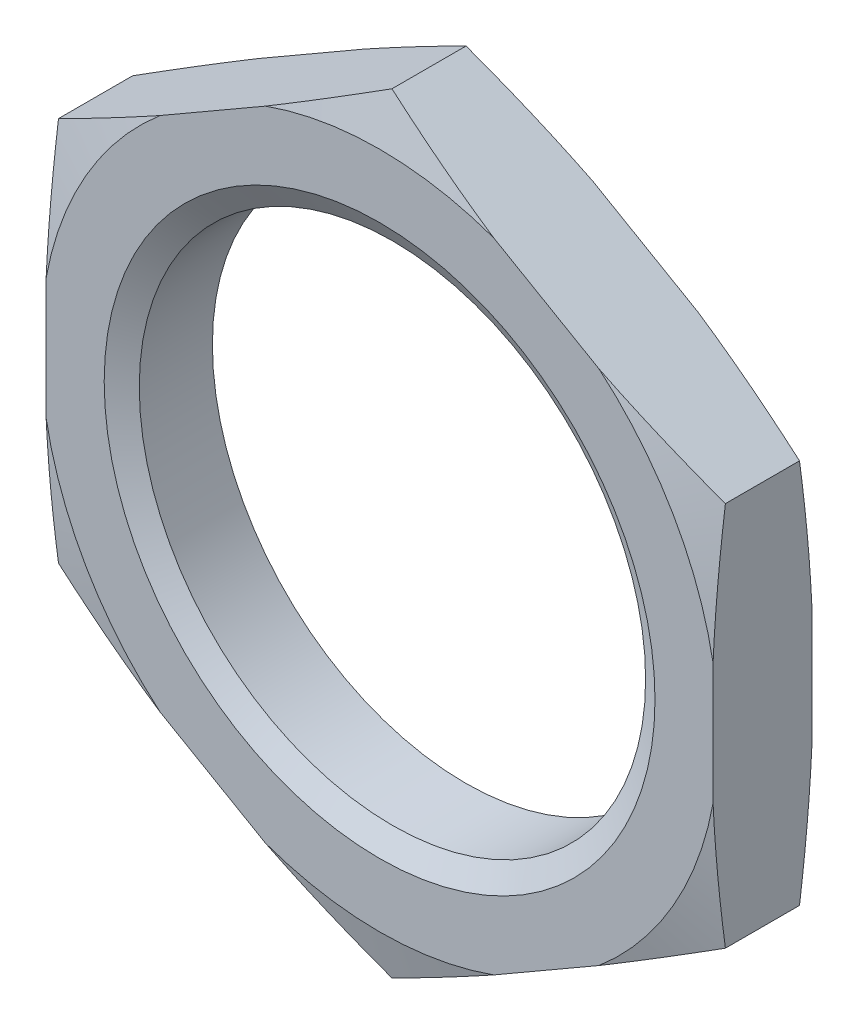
ISO-10303-21;
HEADER;
FILE_DESCRIPTION(('STEP AP214'),'2;1');
FILE_NAME('part.step','',(''),(''),'','','');
FILE_SCHEMA(('AUTOMOTIVE_DESIGN { 1 0 10303 214 1 1 1 1 }'));
ENDSEC;
DATA;
#1=APPLICATION_CONTEXT('core data for automotive mechanical design processes');
#2=APPLICATION_PROTOCOL_DEFINITION('international standard','automotive_design',2000,#1);
#3=PRODUCT_CONTEXT('',#1,'mechanical');
#4=PRODUCT('Part','Part','',(#3));
#5=PRODUCT_RELATED_PRODUCT_CATEGORY('part','',(#4));
#6=PRODUCT_DEFINITION_FORMATION('','',#4);
#7=PRODUCT_DEFINITION_CONTEXT('part definition',#1,'design');
#8=PRODUCT_DEFINITION('design','',#6,#7);
#9=PRODUCT_DEFINITION_SHAPE('','',#8);
#10=(LENGTH_UNIT() NAMED_UNIT(*) SI_UNIT(.MILLI.,.METRE.));
#11=(NAMED_UNIT(*) PLANE_ANGLE_UNIT() SI_UNIT($,.RADIAN.));
#12=(NAMED_UNIT(*) SI_UNIT($,.STERADIAN.) SOLID_ANGLE_UNIT());
#13=UNCERTAINTY_MEASURE_WITH_UNIT(LENGTH_MEASURE(1.E-05),#10,'distance_accuracy_value','');
#14=(GEOMETRIC_REPRESENTATION_CONTEXT(3) GLOBAL_UNCERTAINTY_ASSIGNED_CONTEXT((#13)) GLOBAL_UNIT_ASSIGNED_CONTEXT((#10,
#11,#12)) REPRESENTATION_CONTEXT('',''));
#15=CARTESIAN_POINT('',(0.,0.,0.));
#16=DIRECTION('',(0.,0.,1.));
#17=DIRECTION('',(1.,0.,0.));
#18=AXIS2_PLACEMENT_3D('',#15,#16,#17);
#19=CARTESIAN_POINT('',(0.,0.,4.));
#20=DIRECTION('',(0.,0.,1.));
#21=DIRECTION('',(1.,0.,0.));
#22=AXIS2_PLACEMENT_3D('',#19,#20,#21);
#23=CONICAL_SURFACE('',#22,11.15,1.0471975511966);
#24=CARTESIAN_POINT('',(0.,0.,3.48038475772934));
#25=DIRECTION('',(0.,0.,-1.));
#26=DIRECTION('',(-1.,0.,0.));
#27=AXIS2_PLACEMENT_3D('',#24,#25,#26);
#28=CIRCLE('',#27,10.25);
#29=CARTESIAN_POINT('',(-10.25,0.,3.48038475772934));
#30=VERTEX_POINT('',#29);
#31=EDGE_CURVE('E175',#30,#30,#28,.T.);
#32=ORIENTED_EDGE('',*,*,#31,.T.);
#33=EDGE_LOOP('',(#32));
#34=FACE_BOUND('',#33,.T.);
#35=CARTESIAN_POINT('',(0.,0.,4.));
#36=DIRECTION('',(0.,0.,1.));
#37=DIRECTION('',(1.,0.,0.));
#38=AXIS2_PLACEMENT_3D('',#35,#36,#37);
#39=CIRCLE('',#38,11.15);
#40=CARTESIAN_POINT('',(11.15,0.,4.));
#41=VERTEX_POINT('',#40);
#42=EDGE_CURVE('E430',#41,#41,#39,.T.);
#43=ORIENTED_EDGE('',*,*,#42,.T.);
#44=EDGE_LOOP('',(#43));
#45=FACE_BOUND('',#44,.T.);
#46=ADVANCED_FACE('F15',(#34,#45),#23,.F.);
#47=CARTESIAN_POINT('',(0.,0.,3.497));
#48=DIRECTION('',(0.,0.,-1.));
#49=DIRECTION('',(-1.,0.,0.));
#50=AXIS2_PLACEMENT_3D('',#47,#48,#49);
#51=CONICAL_SURFACE('',#50,15.5996534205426,1.30899693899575);
#52=CARTESIAN_POINT('',(0.,0.,4.));
#53=DIRECTION('',(0.,0.,-1.));
#54=DIRECTION('',(-1.,0.,0.));
#55=AXIS2_PLACEMENT_3D('',#52,#53,#54);
#56=CIRCLE('',#55,13.7224318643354);
#57=CARTESIAN_POINT('',(-8.8810448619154,-10.4609836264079,4.));
#58=VERTEX_POINT('',#57);
#59=CARTESIAN_POINT('',(-13.5,-2.46071864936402,4.));
#60=VERTEX_POINT('',#59);
#61=EDGE_CURVE('E433',#58,#60,#56,.T.);
#62=ORIENTED_EDGE('',*,*,#61,.T.);
#63=CARTESIAN_POINT('',(-13.5,-2.46071864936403,4.));
#64=CARTESIAN_POINT('',(-13.5,-2.90688417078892,3.97859689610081));
#65=CARTESIAN_POINT('',(-13.5,-3.35275366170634,3.95149409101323));
#66=CARTESIAN_POINT('',(-13.5,-4.24353273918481,3.88683268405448));
#67=CARTESIAN_POINT('',(-13.5,-4.68844267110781,3.84927886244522));
#68=CARTESIAN_POINT('',(-13.5,-5.57730597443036,3.76464126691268));
#69=CARTESIAN_POINT('',(-13.5,-6.02125942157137,3.71755827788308));
#70=CARTESIAN_POINT('',(-13.5,-6.90839120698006,3.61489109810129));
#71=CARTESIAN_POINT('',(-13.5,-7.35156909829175,3.55930303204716));
#72=CARTESIAN_POINT('',(-13.5,-7.79422863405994,3.5));
#73=B_SPLINE_CURVE_WITH_KNOTS('',3,(#63,#64,#65,#66,#67,#68,#69,#70,#71,#72),.UNSPECIFIED.,.F.,
.F.,(4,2,2,2,4),(0.,1.33996726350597,2.67932263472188,4.01856773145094,5.35842487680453),.UNSPECIFIED.);
#74=CARTESIAN_POINT('',(-13.5,-7.79422863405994,3.5));
#75=VERTEX_POINT('',#74);
#76=EDGE_CURVE('E158',#60,#75,#73,.T.);
#77=ORIENTED_EDGE('',*,*,#76,.T.);
#78=CARTESIAN_POINT('',(-13.5,-7.79422863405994,3.5));
#79=CARTESIAN_POINT('',(-13.1166455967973,-8.01555840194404,3.55930303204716));
#80=CARTESIAN_POINT('',(-12.7328422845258,-8.23714734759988,3.61489109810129));
#81=CARTESIAN_POINT('',(-11.9645636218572,-8.68071324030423,3.71755827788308));
#82=CARTESIAN_POINT('',(-11.5800886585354,-8.90268996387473,3.76464126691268));
#83=CARTESIAN_POINT('',(-10.8103104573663,-9.34712161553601,3.84927886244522));
#84=CARTESIAN_POINT('',(-10.425007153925,-9.56957658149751,3.88683268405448));
#85=CARTESIAN_POINT('',(-9.653569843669,-10.0149661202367,3.95149409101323));
#86=CARTESIAN_POINT('',(-9.26743553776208,-10.2379008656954,3.97859689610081));
#87=CARTESIAN_POINT('',(-8.8810448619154,-10.4609836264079,4.));
#88=B_SPLINE_CURVE_WITH_KNOTS('',3,(#78,#79,#80,#81,#82,#83,#84,#85,#86,#87),.UNSPECIFIED.,.F.,
.F.,(4,2,2,2,4),(0.,1.33985714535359,2.67910224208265,4.01845761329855,5.35842487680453),.UNSPECIFIED.);
#89=EDGE_CURVE('E169',#75,#58,#88,.T.);
#90=ORIENTED_EDGE('',*,*,#89,.T.);
#91=EDGE_LOOP('',(#62,#77,#90));
#92=FACE_BOUND('',#91,.T.);
#93=ADVANCED_FACE('F489',(#92),#51,.T.);
#94=CARTESIAN_POINT('',(0.,0.,3.497));
#95=DIRECTION('',(0.,0.,-1.));
#96=DIRECTION('',(0.,1.,0.));
#97=AXIS2_PLACEMENT_3D('',#94,#95,#96);
#98=CONICAL_SURFACE('',#97,15.5996534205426,1.30899693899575);
#99=CARTESIAN_POINT('',(0.,0.,4.));
#100=DIRECTION('',(0.,0.,-1.));
#101=DIRECTION('',(0.,1.,0.));
#102=AXIS2_PLACEMENT_3D('',#99,#100,#101);
#103=CIRCLE('',#102,13.7224318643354);
#104=CARTESIAN_POINT('',(-13.5,2.46071864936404,4.));
#105=VERTEX_POINT('',#104);
#106=CARTESIAN_POINT('',(-8.88104486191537,10.4609836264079,4.));
#107=VERTEX_POINT('',#106);
#108=EDGE_CURVE('E18',#105,#107,#103,.T.);
#109=ORIENTED_EDGE('',*,*,#108,.T.);
#110=CARTESIAN_POINT('',(-8.88104486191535,10.4609836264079,4.));
#111=CARTESIAN_POINT('',(-9.26743553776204,10.2379008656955,3.97859689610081));
#112=CARTESIAN_POINT('',(-9.65356984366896,10.0149661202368,3.95149409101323));
#113=CARTESIAN_POINT('',(-10.425007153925,9.56957658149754,3.88683268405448));
#114=CARTESIAN_POINT('',(-10.8103104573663,9.34712161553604,3.84927886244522));
#115=CARTESIAN_POINT('',(-11.5800886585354,8.90268996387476,3.76464126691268));
#116=CARTESIAN_POINT('',(-11.9645636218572,8.68071324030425,3.71755827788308));
#117=CARTESIAN_POINT('',(-12.7328422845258,8.2371473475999,3.61489109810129));
#118=CARTESIAN_POINT('',(-13.1166455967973,8.01555840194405,3.55930303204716));
#119=CARTESIAN_POINT('',(-13.5,7.79422863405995,3.5));
#120=B_SPLINE_CURVE_WITH_KNOTS('',3,(#110,#111,#112,#113,#114,#115,#116,#117,#118,#119),
.UNSPECIFIED.,.F.,.F.,(4,2,2,2,4),(0.,1.33996726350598,2.6793226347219,4.01856773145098,
5.35842487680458),.UNSPECIFIED.);
#121=CARTESIAN_POINT('',(-13.5,7.79422863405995,3.5));
#122=VERTEX_POINT('',#121);
#123=EDGE_CURVE('E141',#107,#122,#120,.T.);
#124=ORIENTED_EDGE('',*,*,#123,.T.);
#125=CARTESIAN_POINT('',(-13.5,7.79422863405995,3.5));
#126=CARTESIAN_POINT('',(-13.5,7.35156909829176,3.55930303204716));
#127=CARTESIAN_POINT('',(-13.5,6.90839120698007,3.61489109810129));
#128=CARTESIAN_POINT('',(-13.5,6.02125942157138,3.71755827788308));
#129=CARTESIAN_POINT('',(-13.5,5.57730597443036,3.76464126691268));
#130=CARTESIAN_POINT('',(-13.5,4.68844267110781,3.84927886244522));
#131=CARTESIAN_POINT('',(-13.5,4.24353273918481,3.88683268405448));
#132=CARTESIAN_POINT('',(-13.5,3.35275366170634,3.95149409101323));
#133=CARTESIAN_POINT('',(-13.5,2.90688417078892,3.97859689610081));
#134=CARTESIAN_POINT('',(-13.5,2.46071864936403,4.));
#135=B_SPLINE_CURVE_WITH_KNOTS('',3,(#125,#126,#127,#128,#129,#130,#131,#132,#133,#134),
.UNSPECIFIED.,.F.,.F.,(4,2,2,2,4),(0.,1.33985714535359,2.67910224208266,4.01845761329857,
5.35842487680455),.UNSPECIFIED.);
#136=EDGE_CURVE('E136',#122,#105,#135,.T.);
#137=ORIENTED_EDGE('',*,*,#136,.T.);
#138=EDGE_LOOP('',(#109,#124,#137));
#139=FACE_BOUND('',#138,.T.);
#140=ADVANCED_FACE('F138',(#139),#98,.T.);
#141=CARTESIAN_POINT('',(0.,0.,3.497));
#142=DIRECTION('',(0.,0.,-1.));
#143=DIRECTION('',(0.,1.,0.));
#144=AXIS2_PLACEMENT_3D('',#141,#142,#143);
#145=CONICAL_SURFACE('',#144,15.5996534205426,1.30899693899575);
#146=CARTESIAN_POINT('',(0.,0.,4.));
#147=DIRECTION('',(0.,0.,-1.));
#148=DIRECTION('',(0.,1.,0.));
#149=AXIS2_PLACEMENT_3D('',#146,#147,#148);
#150=CIRCLE('',#149,13.7224318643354);
#151=CARTESIAN_POINT('',(-4.61895513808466,12.9217022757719,4.));
#152=VERTEX_POINT('',#151);
#153=CARTESIAN_POINT('',(4.61895513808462,12.9217022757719,4.));
#154=VERTEX_POINT('',#153);
#155=EDGE_CURVE('E155',#152,#154,#150,.T.);
#156=ORIENTED_EDGE('',*,*,#155,.T.);
#157=CARTESIAN_POINT('',(4.61895513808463,12.9217022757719,4.));
#158=CARTESIAN_POINT('',(4.23256446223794,13.1447850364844,3.97859689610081));
#159=CARTESIAN_POINT('',(3.84643015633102,13.3677197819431,3.95149409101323));
#160=CARTESIAN_POINT('',(3.074992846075,13.8131093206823,3.88683268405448));
#161=CARTESIAN_POINT('',(2.68968954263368,14.0355642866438,3.84927886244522));
#162=CARTESIAN_POINT('',(1.91991134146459,14.4799959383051,3.76464126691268));
#163=CARTESIAN_POINT('',(1.5354363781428,14.7019726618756,3.71755827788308));
#164=CARTESIAN_POINT('',(0.76715771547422,15.14553855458,3.61489109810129));
#165=CARTESIAN_POINT('',(0.38335440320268,15.3671275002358,3.55930303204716));
#166=CARTESIAN_POINT('',(0.,15.5884572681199,3.5));
#167=B_SPLINE_CURVE_WITH_KNOTS('',3,(#157,#158,#159,#160,#161,#162,#163,#164,#165,#166),
.UNSPECIFIED.,.F.,.F.,(4,2,2,2,4),(0.,1.33996726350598,2.67932263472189,4.01856773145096,
5.35842487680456),.UNSPECIFIED.);
#168=CARTESIAN_POINT('',(0.,15.5884572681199,3.5));
#169=VERTEX_POINT('',#168);
#170=EDGE_CURVE('E274',#154,#169,#167,.T.);
#171=ORIENTED_EDGE('',*,*,#170,.T.);
#172=CARTESIAN_POINT('',(0.,15.5884572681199,3.5));
#173=CARTESIAN_POINT('',(-0.383354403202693,15.3671275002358,3.55930303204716));
#174=CARTESIAN_POINT('',(-0.767157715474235,15.14553855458,3.61489109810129));
#175=CARTESIAN_POINT('',(-1.53543637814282,14.7019726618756,3.71755827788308));
#176=CARTESIAN_POINT('',(-1.91991134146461,14.4799959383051,3.76464126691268));
#177=CARTESIAN_POINT('',(-2.6896895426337,14.0355642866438,3.84927886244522));
#178=CARTESIAN_POINT('',(-3.07499284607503,13.8131093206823,3.88683268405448));
#179=CARTESIAN_POINT('',(-3.84643015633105,13.3677197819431,3.95149409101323));
#180=CARTESIAN_POINT('',(-4.23256446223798,13.1447850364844,3.97859689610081));
#181=CARTESIAN_POINT('',(-4.61895513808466,12.9217022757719,4.));
#182=B_SPLINE_CURVE_WITH_KNOTS('',3,(#172,#173,#174,#175,#176,#177,#178,#179,#180,#181),
.UNSPECIFIED.,.F.,.F.,(4,2,2,2,4),(0.,1.3398571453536,2.67910224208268,4.0184576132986,
5.35842487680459),.UNSPECIFIED.);
#183=EDGE_CURVE('E281',#169,#152,#182,.T.);
#184=ORIENTED_EDGE('',*,*,#183,.T.);
#185=EDGE_LOOP('',(#156,#171,#184));
#186=FACE_BOUND('',#185,.T.);
#187=ADVANCED_FACE('F310',(#186),#145,.T.);
#188=CARTESIAN_POINT('',(0.,0.,3.497));
#189=DIRECTION('',(0.,0.,-1.));
#190=DIRECTION('',(0.,1.,0.));
#191=AXIS2_PLACEMENT_3D('',#188,#189,#190);
#192=CONICAL_SURFACE('',#191,15.5996534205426,1.30899693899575);
#193=CARTESIAN_POINT('',(13.5,2.46071864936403,4.));
#194=CARTESIAN_POINT('',(13.5,2.90688417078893,3.97859689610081));
#195=CARTESIAN_POINT('',(13.5,3.35275366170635,3.95149409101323));
#196=CARTESIAN_POINT('',(13.5,4.24353273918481,3.88683268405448));
#197=CARTESIAN_POINT('',(13.5,4.68844267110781,3.84927886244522));
#198=CARTESIAN_POINT('',(13.5,5.57730597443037,3.76464126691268));
#199=CARTESIAN_POINT('',(13.5,6.02125942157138,3.71755827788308));
#200=CARTESIAN_POINT('',(13.5,6.90839120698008,3.61489109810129));
#201=CARTESIAN_POINT('',(13.5,7.35156909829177,3.55930303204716));
#202=CARTESIAN_POINT('',(13.5,7.79422863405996,3.5));
#203=B_SPLINE_CURVE_WITH_KNOTS('',3,(#193,#194,#195,#196,#197,#198,#199,#200,#201,#202),
.UNSPECIFIED.,.F.,.F.,(4,2,2,2,4),(0.,1.33996726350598,2.67932263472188,4.01856773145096,
5.35842487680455),.UNSPECIFIED.);
#204=CARTESIAN_POINT('',(13.5,2.46071864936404,4.));
#205=VERTEX_POINT('',#204);
#206=CARTESIAN_POINT('',(13.5,7.79422863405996,3.5));
#207=VERTEX_POINT('',#206);
#208=EDGE_CURVE('E266',#205,#207,#203,.T.);
#209=ORIENTED_EDGE('',*,*,#208,.T.);
#210=CARTESIAN_POINT('',(13.5,7.79422863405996,3.5));
#211=CARTESIAN_POINT('',(13.1166455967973,8.01555840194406,3.55930303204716));
#212=CARTESIAN_POINT('',(12.7328422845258,8.2371473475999,3.61489109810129));
#213=CARTESIAN_POINT('',(11.9645636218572,8.68071324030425,3.71755827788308));
#214=CARTESIAN_POINT('',(11.5800886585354,8.90268996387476,3.76464126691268));
#215=CARTESIAN_POINT('',(10.8103104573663,9.34712161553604,3.84927886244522));
#216=CARTESIAN_POINT('',(10.425007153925,9.56957658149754,3.88683268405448));
#217=CARTESIAN_POINT('',(9.65356984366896,10.0149661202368,3.95149409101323));
#218=CARTESIAN_POINT('',(9.26743553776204,10.2379008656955,3.97859689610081));
#219=CARTESIAN_POINT('',(8.88104486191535,10.4609836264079,4.));
#220=B_SPLINE_CURVE_WITH_KNOTS('',3,(#210,#211,#212,#213,#214,#215,#216,#217,#218,#219),
.UNSPECIFIED.,.F.,.F.,(4,2,2,2,4),(0.,1.3398571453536,2.67910224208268,4.01845761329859,
5.35842487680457),.UNSPECIFIED.);
#221=CARTESIAN_POINT('',(8.88104486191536,10.4609836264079,4.));
#222=VERTEX_POINT('',#221);
#223=EDGE_CURVE('E278',#207,#222,#220,.T.);
#224=ORIENTED_EDGE('',*,*,#223,.T.);
#225=CARTESIAN_POINT('',(0.,0.,4.));
#226=DIRECTION('',(0.,0.,-1.));
#227=DIRECTION('',(0.,1.,0.));
#228=AXIS2_PLACEMENT_3D('',#225,#226,#227);
#229=CIRCLE('',#228,13.7224318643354);
#230=EDGE_CURVE('E427',#222,#205,#229,.T.);
#231=ORIENTED_EDGE('',*,*,#230,.T.);
#232=EDGE_LOOP('',(#209,#224,#231));
#233=FACE_BOUND('',#232,.T.);
#234=ADVANCED_FACE('F314',(#233),#192,.T.);
#235=CARTESIAN_POINT('',(0.,0.,3.497));
#236=DIRECTION('',(0.,0.,-1.));
#237=DIRECTION('',(0.,1.,0.));
#238=AXIS2_PLACEMENT_3D('',#235,#236,#237);
#239=CONICAL_SURFACE('',#238,15.5996534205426,1.30899693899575);
#240=CARTESIAN_POINT('',(0.,0.,4.));
#241=DIRECTION('',(0.,0.,-1.));
#242=DIRECTION('',(0.,1.,0.));
#243=AXIS2_PLACEMENT_3D('',#240,#241,#242);
#244=CIRCLE('',#243,13.7224318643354);
#245=CARTESIAN_POINT('',(4.61895513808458,-12.921702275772,4.));
#246=VERTEX_POINT('',#245);
#247=CARTESIAN_POINT('',(-4.61895513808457,-12.921702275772,4.));
#248=VERTEX_POINT('',#247);
#249=EDGE_CURVE('E440',#246,#248,#244,.T.);
#250=ORIENTED_EDGE('',*,*,#249,.T.);
#251=CARTESIAN_POINT('',(-4.61895513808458,-12.921702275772,4.));
#252=CARTESIAN_POINT('',(-4.2325644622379,-13.1447850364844,3.97859689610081));
#253=CARTESIAN_POINT('',(-3.84643015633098,-13.3677197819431,3.95149409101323));
#254=CARTESIAN_POINT('',(-3.07499284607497,-13.8131093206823,3.88683268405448));
#255=CARTESIAN_POINT('',(-2.68968954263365,-14.0355642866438,3.84927886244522));
#256=CARTESIAN_POINT('',(-1.91991134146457,-14.4799959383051,3.76464126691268));
#257=CARTESIAN_POINT('',(-1.53543637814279,-14.7019726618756,3.71755827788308));
#258=CARTESIAN_POINT('',(-0.767157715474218,-15.1455385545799,3.61489109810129));
#259=CARTESIAN_POINT('',(-0.383354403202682,-15.3671275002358,3.55930303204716));
#260=CARTESIAN_POINT('',(0.,-15.5884572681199,3.5));
#261=B_SPLINE_CURVE_WITH_KNOTS('',3,(#251,#252,#253,#254,#255,#256,#257,#258,#259,#260),
.UNSPECIFIED.,.F.,.F.,(4,2,2,2,4),(0.,1.33996726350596,2.67932263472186,4.01856773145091,
5.35842487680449),.UNSPECIFIED.);
#262=CARTESIAN_POINT('',(0.,-15.5884572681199,3.5));
#263=VERTEX_POINT('',#262);
#264=EDGE_CURVE('E168',#248,#263,#261,.T.);
#265=ORIENTED_EDGE('',*,*,#264,.T.);
#266=CARTESIAN_POINT('',(0.,-15.5884572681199,3.5));
#267=CARTESIAN_POINT('',(0.383354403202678,-15.3671275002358,3.55930303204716));
#268=CARTESIAN_POINT('',(0.767157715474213,-15.14553855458,3.61489109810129));
#269=CARTESIAN_POINT('',(1.53543637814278,-14.7019726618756,3.71755827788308));
#270=CARTESIAN_POINT('',(1.91991134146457,-14.4799959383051,3.76464126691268));
#271=CARTESIAN_POINT('',(2.68968954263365,-14.0355642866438,3.84927886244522));
#272=CARTESIAN_POINT('',(3.07499284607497,-13.8131093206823,3.88683268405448));
#273=CARTESIAN_POINT('',(3.84643015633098,-13.3677197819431,3.95149409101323));
#274=CARTESIAN_POINT('',(4.2325644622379,-13.1447850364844,3.97859689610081));
#275=CARTESIAN_POINT('',(4.61895513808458,-12.921702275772,4.));
#276=B_SPLINE_CURVE_WITH_KNOTS('',3,(#266,#267,#268,#269,#270,#271,#272,#273,#274,#275),
.UNSPECIFIED.,.F.,.F.,(4,2,2,2,4),(0.,1.33985714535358,2.67910224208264,4.01845761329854,
5.3584248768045),.UNSPECIFIED.);
#277=EDGE_CURVE('E262',#263,#246,#276,.T.);
#278=ORIENTED_EDGE('',*,*,#277,.T.);
#279=EDGE_LOOP('',(#250,#265,#278));
#280=FACE_BOUND('',#279,.T.);
#281=ADVANCED_FACE('F371',(#280),#239,.T.);
#282=CARTESIAN_POINT('',(13.5,7.79422863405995,4.));
#283=DIRECTION('',(0.,0.,-1.));
#284=DIRECTION('',(-1.,0.,0.));
#285=AXIS2_PLACEMENT_3D('',#282,#283,#284);
#286=PLANE('',#285);
#287=ORIENTED_EDGE('',*,*,#42,.F.);
#288=EDGE_LOOP('',(#287));
#289=FACE_BOUND('',#288,.T.);
#290=ORIENTED_EDGE('',*,*,#61,.F.);
#291=DIRECTION('',(-0.866025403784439,0.5,0.));
#292=VECTOR('',#291,1.);
#293=CARTESIAN_POINT('',(-13.5,-7.79422863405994,4.));
#294=LINE('',#293,#292);
#295=EDGE_CURVE('E165',#58,#248,#294,.F.);
#296=ORIENTED_EDGE('',*,*,#295,.T.);
#297=ORIENTED_EDGE('',*,*,#249,.F.);
#298=DIRECTION('',(-0.866025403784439,-0.5,0.));
#299=VECTOR('',#298,1.);
#300=CARTESIAN_POINT('',(0.,-15.5884572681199,4.));
#301=LINE('',#300,#299);
#302=CARTESIAN_POINT('',(8.88104486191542,-10.4609836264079,4.));
#303=VERTEX_POINT('',#302);
#304=EDGE_CURVE('E258',#246,#303,#301,.F.);
#305=ORIENTED_EDGE('',*,*,#304,.T.);
#306=CARTESIAN_POINT('',(0.,0.,4.));
#307=DIRECTION('',(0.,0.,-1.));
#308=DIRECTION('',(0.,1.,0.));
#309=AXIS2_PLACEMENT_3D('',#306,#307,#308);
#310=CIRCLE('',#309,13.7224318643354);
#311=CARTESIAN_POINT('',(13.5,-2.46071864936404,4.));
#312=VERTEX_POINT('',#311);
#313=EDGE_CURVE('E177',#312,#303,#310,.T.);
#314=ORIENTED_EDGE('',*,*,#313,.F.);
#315=DIRECTION('',(0.,1.,0.));
#316=VECTOR('',#315,1.);
#317=CARTESIAN_POINT('',(13.5,-7.79422863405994,4.));
#318=LINE('',#317,#316);
#319=EDGE_CURVE('E267',#312,#205,#318,.T.);
#320=ORIENTED_EDGE('',*,*,#319,.T.);
#321=ORIENTED_EDGE('',*,*,#230,.F.);
#322=DIRECTION('',(0.866025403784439,-0.499999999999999,0.));
#323=VECTOR('',#322,1.);
#324=CARTESIAN_POINT('',(13.5,7.79422863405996,4.));
#325=LINE('',#324,#323);
#326=EDGE_CURVE('E275',#222,#154,#325,.F.);
#327=ORIENTED_EDGE('',*,*,#326,.T.);
#328=ORIENTED_EDGE('',*,*,#155,.F.);
#329=DIRECTION('',(0.866025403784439,0.5,0.));
#330=VECTOR('',#329,1.);
#331=CARTESIAN_POINT('',(0.,15.5884572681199,4.));
#332=LINE('',#331,#330);
#333=EDGE_CURVE('E154',#152,#107,#332,.F.);
#334=ORIENTED_EDGE('',*,*,#333,.T.);
#335=ORIENTED_EDGE('',*,*,#108,.F.);
#336=DIRECTION('',(0.,1.,0.));
#337=VECTOR('',#336,1.);
#338=CARTESIAN_POINT('',(-13.5,7.79422863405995,4.));
#339=LINE('',#338,#337);
#340=EDGE_CURVE('E145',#105,#60,#339,.F.);
#341=ORIENTED_EDGE('',*,*,#340,.T.);
#342=EDGE_LOOP('',(#290,#296,#297,#305,#314,#320,#321,#327,#328,#334,#335,#341));
#343=FACE_BOUND('',#342,.T.);
#344=ADVANCED_FACE('F151',(#289,#343),#286,.F.);
#345=CARTESIAN_POINT('',(0.,0.,3.497));
#346=DIRECTION('',(0.,0.,-1.));
#347=DIRECTION('',(0.,1.,0.));
#348=AXIS2_PLACEMENT_3D('',#345,#346,#347);
#349=CONICAL_SURFACE('',#348,15.5996534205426,1.30899693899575);
#350=ORIENTED_EDGE('',*,*,#313,.T.);
#351=CARTESIAN_POINT('',(8.88104486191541,-10.4609836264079,4.));
#352=CARTESIAN_POINT('',(9.26743553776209,-10.2379008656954,3.97859689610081));
#353=CARTESIAN_POINT('',(9.65356984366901,-10.0149661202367,3.95149409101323));
#354=CARTESIAN_POINT('',(10.425007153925,-9.5695765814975,3.88683268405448));
#355=CARTESIAN_POINT('',(10.8103104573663,-9.347121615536,3.84927886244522));
#356=CARTESIAN_POINT('',(11.5800886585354,-8.90268996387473,3.76464126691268));
#357=CARTESIAN_POINT('',(11.9645636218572,-8.68071324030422,3.71755827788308));
#358=CARTESIAN_POINT('',(12.7328422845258,-8.23714734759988,3.61489109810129));
#359=CARTESIAN_POINT('',(13.1166455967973,-8.01555840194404,3.55930303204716));
#360=CARTESIAN_POINT('',(13.5,-7.79422863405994,3.5));
#361=B_SPLINE_CURVE_WITH_KNOTS('',3,(#351,#352,#353,#354,#355,#356,#357,#358,#359,#360),
.UNSPECIFIED.,.F.,.F.,(4,2,2,2,4),(0.,1.33996726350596,2.67932263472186,4.01856773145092,
5.3584248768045),.UNSPECIFIED.);
#362=CARTESIAN_POINT('',(13.5,-7.79422863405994,3.5));
#363=VERTEX_POINT('',#362);
#364=EDGE_CURVE('E235',#303,#363,#361,.T.);
#365=ORIENTED_EDGE('',*,*,#364,.T.);
#366=CARTESIAN_POINT('',(13.5,-7.79422863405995,3.5));
#367=CARTESIAN_POINT('',(13.5,-7.35156909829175,3.55930303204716));
#368=CARTESIAN_POINT('',(13.5,-6.90839120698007,3.61489109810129));
#369=CARTESIAN_POINT('',(13.5,-6.02125942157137,3.71755827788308));
#370=CARTESIAN_POINT('',(13.5,-5.57730597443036,3.76464126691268));
#371=CARTESIAN_POINT('',(13.5,-4.68844267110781,3.84927886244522));
#372=CARTESIAN_POINT('',(13.5,-4.24353273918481,3.88683268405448));
#373=CARTESIAN_POINT('',(13.5,-3.35275366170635,3.95149409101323));
#374=CARTESIAN_POINT('',(13.5,-2.90688417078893,3.97859689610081));
#375=CARTESIAN_POINT('',(13.5,-2.46071864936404,4.));
#376=B_SPLINE_CURVE_WITH_KNOTS('',3,(#366,#367,#368,#369,#370,#371,#372,#373,#374,#375),
.UNSPECIFIED.,.F.,.F.,(4,2,2,2,4),(0.,1.33985714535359,2.67910224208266,4.01845761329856,
5.35842487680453),.UNSPECIFIED.);
#377=EDGE_CURVE('E270',#363,#312,#376,.T.);
#378=ORIENTED_EDGE('',*,*,#377,.T.);
#379=EDGE_LOOP('',(#350,#365,#378));
#380=FACE_BOUND('',#379,.T.);
#381=ADVANCED_FACE('F363',(#380),#349,.T.);
#382=CARTESIAN_POINT('',(0.,0.,4.));
#383=DIRECTION('',(0.,0.,-1.));
#384=DIRECTION('',(-1.,0.,0.));
#385=AXIS2_PLACEMENT_3D('',#382,#383,#384);
#386=CYLINDRICAL_SURFACE('',#385,10.25);
#387=ORIENTED_EDGE('',*,*,#31,.F.);
#388=EDGE_LOOP('',(#387));
#389=FACE_BOUND('',#388,.T.);
#390=CARTESIAN_POINT('',(0.,0.,0.519615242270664));
#391=DIRECTION('',(0.,0.,-1.));
#392=DIRECTION('',(-1.,0.,0.));
#393=AXIS2_PLACEMENT_3D('',#390,#391,#392);
#394=CIRCLE('',#393,10.25);
#395=CARTESIAN_POINT('',(-10.25,0.,0.519615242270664));
#396=VERTEX_POINT('',#395);
#397=EDGE_CURVE('E170',#396,#396,#394,.T.);
#398=ORIENTED_EDGE('',*,*,#397,.T.);
#399=EDGE_LOOP('',(#398));
#400=FACE_BOUND('',#399,.T.);
#401=ADVANCED_FACE('F367',(#389,#400),#386,.F.);
#402=CARTESIAN_POINT('',(-13.5,-7.79422863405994,4.));
#403=DIRECTION('',(0.5,0.866025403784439,0.));
#404=DIRECTION('',(-0.866025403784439,0.5,0.));
#405=AXIS2_PLACEMENT_3D('',#402,#403,#404);
#406=PLANE('',#405);
#407=CARTESIAN_POINT('',(-8.8810448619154,-10.4609836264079,0.));
#408=CARTESIAN_POINT('',(-9.26743553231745,-10.2379008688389,0.021403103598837));
#409=CARTESIAN_POINT('',(-9.65356983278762,-10.0149661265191,0.0485059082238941));
#410=CARTESIAN_POINT('',(-10.4250071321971,-9.5695765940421,0.113167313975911));
#411=CARTESIAN_POINT('',(-10.8103104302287,-9.34712163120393,0.150721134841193));
#412=CARTESIAN_POINT('',(-11.5800886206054,-8.90268998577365,0.235358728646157));
#413=CARTESIAN_POINT('',(-11.9645635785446,-8.6807132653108,0.282441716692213));
#414=CARTESIAN_POINT('',(-12.7328422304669,-8.23714737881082,0.385108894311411));
#415=CARTESIAN_POINT('',(-13.1166455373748,-8.01555843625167,0.440696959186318));
#416=CARTESIAN_POINT('',(-13.4999999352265,-7.79422867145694,0.499999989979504));
#417=B_SPLINE_CURVE_WITH_KNOTS('',3,(#407,#408,#409,#410,#411,#412,#413,#414,#415,#416),
.UNSPECIFIED.,.F.,.F.,(4,2,2,2,4),(0.,1.33996724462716,2.67932259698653,4.01856767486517,
5.35842480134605),.UNSPECIFIED.);
#418=CARTESIAN_POINT('',(-8.88104486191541,-10.4609836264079,0.));
#419=VERTEX_POINT('',#418);
#420=CARTESIAN_POINT('',(-13.499999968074,-7.79422865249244,0.499999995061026));
#421=VERTEX_POINT('',#420);
#422=EDGE_CURVE('E146',#419,#421,#417,.T.);
#423=ORIENTED_EDGE('',*,*,#422,.F.);
#424=DIRECTION('',(-0.866025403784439,0.499999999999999,0.));
#425=VECTOR('',#424,1.);
#426=CARTESIAN_POINT('',(-4.61895513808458,-12.9217022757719,0.));
#427=LINE('',#426,#425);
#428=CARTESIAN_POINT('',(-4.61895513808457,-12.921702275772,0.));
#429=VERTEX_POINT('',#428);
#430=EDGE_CURVE('E173',#429,#419,#427,.T.);
#431=ORIENTED_EDGE('',*,*,#430,.F.);
#432=CARTESIAN_POINT('',(3.96182034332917E-08,-15.5884572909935,0.500000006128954));
#433=CARTESIAN_POINT('',(-0.383354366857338,-15.3671275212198,0.440696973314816));
#434=CARTESIAN_POINT('',(-0.767157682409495,-15.1455385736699,0.385108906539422));
#435=CARTESIAN_POINT('',(-1.53543635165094,-14.7019726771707,0.282441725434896));
#436=CARTESIAN_POINT('',(-1.91991131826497,-14.4799959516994,0.235358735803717));
#437=CARTESIAN_POINT('',(-2.68968952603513,-14.035564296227,0.150721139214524));
#438=CARTESIAN_POINT('',(-3.07499283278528,-13.8131093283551,0.113167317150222));
#439=CARTESIAN_POINT('',(-3.84643014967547,-13.3677197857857,0.0485059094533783));
#440=CARTESIAN_POINT('',(-4.23256445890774,-13.1447850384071,0.021403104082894));
#441=CARTESIAN_POINT('',(-4.61895513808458,-12.9217022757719,0.));
#442=B_SPLINE_CURVE_WITH_KNOTS('',3,(#432,#433,#434,#435,#436,#437,#438,#439,#440,#441),
.UNSPECIFIED.,.F.,.F.,(4,2,2,2,4),(0.,1.33985715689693,2.6791022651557,4.01845764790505,
5.35842492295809),.UNSPECIFIED.);
#443=CARTESIAN_POINT('',(1.9809097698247E-08,-15.5884572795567,0.500000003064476));
#444=VERTEX_POINT('',#443);
#445=EDGE_CURVE('E174',#444,#429,#442,.T.);
#446=ORIENTED_EDGE('',*,*,#445,.F.);
#447=DIRECTION('',(0.,0.,1.));
#448=VECTOR('',#447,1.);
#449=CARTESIAN_POINT('',(0.,-15.5884572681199,4.));
#450=LINE('',#449,#448);
#451=EDGE_CURVE('E246',#444,#263,#450,.T.);
#452=ORIENTED_EDGE('',*,*,#451,.T.);
#453=ORIENTED_EDGE('',*,*,#264,.F.);
#454=ORIENTED_EDGE('',*,*,#295,.F.);
#455=ORIENTED_EDGE('',*,*,#89,.F.);
#456=DIRECTION('',(0.,0.,1.));
#457=VECTOR('',#456,1.);
#458=CARTESIAN_POINT('',(-13.5,-7.79422863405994,4.));
#459=LINE('',#458,#457);
#460=EDGE_CURVE('E160',#75,#421,#459,.F.);
#461=ORIENTED_EDGE('',*,*,#460,.T.);
#462=EDGE_LOOP('',(#423,#431,#446,#452,#453,#454,#455,#461));
#463=FACE_BOUND('',#462,.T.);
#464=ADVANCED_FACE('F213',(#463),#406,.F.);
#465=CARTESIAN_POINT('',(0.,0.,0.502999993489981));
#466=DIRECTION('',(0.,0.,1.));
#467=DIRECTION('',(0.,-1.,0.));
#468=AXIS2_PLACEMENT_3D('',#465,#466,#467);
#469=CONICAL_SURFACE('',#468,15.5996533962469,1.30899693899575);
#470=ORIENTED_EDGE('',*,*,#422,.T.);
#471=CARTESIAN_POINT('',(-13.4999999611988,-7.79422863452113,0.500000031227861));
#472=CARTESIAN_POINT('',(-13.4999999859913,-7.35156910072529,0.440696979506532));
#473=CARTESIAN_POINT('',(-13.4999999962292,-6.90839120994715,0.385108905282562));
#474=CARTESIAN_POINT('',(-13.5000000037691,-6.02125942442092,0.282441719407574));
#475=CARTESIAN_POINT('',(-13.500000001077,-5.57730597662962,0.235358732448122));
#476=CARTESIAN_POINT('',(-13.499999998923,-4.68844267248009,0.150721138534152));
#477=CARTESIAN_POINT('',(-13.4999999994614,-4.24353274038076,0.113167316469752));
#478=CARTESIAN_POINT('',(-13.5000000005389,-3.35275366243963,0.0485059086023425));
#479=CARTESIAN_POINT('',(-13.500000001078,-2.90688417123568,0.0214031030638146));
#480=CARTESIAN_POINT('',(-13.5,-2.46071864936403,0.));
#481=B_SPLINE_CURVE_WITH_KNOTS('',3,(#471,#472,#473,#474,#475,#476,#477,#478,#479,#480),
.UNSPECIFIED.,.F.,.F.,(4,2,2,2,4),(0.,1.33985714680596,2.67910224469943,4.01845761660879,
5.35842488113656),.UNSPECIFIED.);
#482=CARTESIAN_POINT('',(-13.5,-2.46071864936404,0.));
#483=VERTEX_POINT('',#482);
#484=EDGE_CURVE('E289',#421,#483,#481,.T.);
#485=ORIENTED_EDGE('',*,*,#484,.T.);
#486=CARTESIAN_POINT('',(0.,0.,0.));
#487=DIRECTION('',(0.,0.,1.));
#488=DIRECTION('',(0.,-1.,0.));
#489=AXIS2_PLACEMENT_3D('',#486,#487,#488);
#490=CIRCLE('',#489,13.7224318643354);
#491=EDGE_CURVE('E198',#419,#483,#490,.F.);
#492=ORIENTED_EDGE('',*,*,#491,.F.);
#493=EDGE_LOOP('',(#470,#485,#492));
#494=FACE_BOUND('',#493,.T.);
#495=ADVANCED_FACE('F463',(#494),#469,.T.);
#496=CARTESIAN_POINT('',(-13.5,7.79422863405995,4.));
#497=DIRECTION('',(1.,0.,0.));
#498=DIRECTION('',(0.,1.,0.));
#499=AXIS2_PLACEMENT_3D('',#496,#497,#498);
#500=PLANE('',#499);
#501=CARTESIAN_POINT('',(-13.5,2.46071864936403,0.));
#502=CARTESIAN_POINT('',(-13.5,2.90688416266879,0.0214031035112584));
#503=CARTESIAN_POINT('',(-13.5,3.35275364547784,0.0485059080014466));
#504=CARTESIAN_POINT('',(-13.5,4.24353270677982,0.113167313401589));
#505=CARTESIAN_POINT('',(-13.5,4.68844263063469,0.150721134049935));
#506=CARTESIAN_POINT('',(-13.5,5.57730591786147,0.235358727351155));
#507=CARTESIAN_POINT('',(-13.5,6.02125935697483,0.282441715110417));
#508=CARTESIAN_POINT('',(-13.5,6.90839112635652,0.385108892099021));
#509=CARTESIAN_POINT('',(-13.5,7.35156900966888,0.440696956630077));
#510=CARTESIAN_POINT('',(-13.5,7.79422853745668,0.499999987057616));
#511=B_SPLINE_CURVE_WITH_KNOTS('',3,(#501,#502,#503,#504,#505,#506,#507,#508,#509,#510),
.UNSPECIFIED.,.F.,.F.,(4,2,2,2,4),(0.,1.33996723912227,2.67932258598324,4.01856765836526,
5.35842477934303),.UNSPECIFIED.);
#512=CARTESIAN_POINT('',(-13.5,2.46071864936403,0.));
#513=VERTEX_POINT('',#512);
#514=CARTESIAN_POINT('',(-13.5,7.79422858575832,0.499999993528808));
#515=VERTEX_POINT('',#514);
#516=EDGE_CURVE('E284',#513,#515,#511,.T.);
#517=ORIENTED_EDGE('',*,*,#516,.F.);
#518=DIRECTION('',(0.,1.,0.));
#519=VECTOR('',#518,1.);
#520=CARTESIAN_POINT('',(-13.5,7.79422863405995,0.));
#521=LINE('',#520,#519);
#522=EDGE_CURVE('E197',#483,#513,#521,.T.);
#523=ORIENTED_EDGE('',*,*,#522,.F.);
#524=ORIENTED_EDGE('',*,*,#484,.F.);
#525=ORIENTED_EDGE('',*,*,#460,.F.);
#526=ORIENTED_EDGE('',*,*,#76,.F.);
#527=ORIENTED_EDGE('',*,*,#340,.F.);
#528=ORIENTED_EDGE('',*,*,#136,.F.);
#529=DIRECTION('',(0.,0.,1.));
#530=VECTOR('',#529,1.);
#531=CARTESIAN_POINT('',(-13.5,7.79422863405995,4.));
#532=LINE('',#531,#530);
#533=EDGE_CURVE('E279',#122,#515,#532,.F.);
#534=ORIENTED_EDGE('',*,*,#533,.T.);
#535=EDGE_LOOP('',(#517,#523,#524,#525,#526,#527,#528,#534));
#536=FACE_BOUND('',#535,.T.);
#537=ADVANCED_FACE('F156',(#536),#500,.F.);
#538=CARTESIAN_POINT('',(0.,0.,0.503));
#539=DIRECTION('',(0.,0.,1.));
#540=DIRECTION('',(1.,0.,0.));
#541=AXIS2_PLACEMENT_3D('',#538,#539,#540);
#542=CONICAL_SURFACE('',#541,15.5996534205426,1.30899693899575);
#543=ORIENTED_EDGE('',*,*,#516,.T.);
#544=CARTESIAN_POINT('',(-13.5000000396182,7.79422861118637,0.500000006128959));
#545=CARTESIAN_POINT('',(-13.1166456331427,8.01555838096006,0.440696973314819));
#546=CARTESIAN_POINT('',(-12.7328423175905,8.23714732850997,0.385108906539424));
#547=CARTESIAN_POINT('',(-11.964563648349,8.68071322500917,0.282441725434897));
#548=CARTESIAN_POINT('',(-11.580088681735,8.90268995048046,0.235358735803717));
#549=CARTESIAN_POINT('',(-10.8103104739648,9.34712160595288,0.150721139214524));
#550=CARTESIAN_POINT('',(-10.4250071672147,9.56957657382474,0.113167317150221));
#551=CARTESIAN_POINT('',(-9.65356985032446,10.0149661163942,0.0485059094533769));
#552=CARTESIAN_POINT('',(-9.26743554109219,10.2379008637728,0.0214031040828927));
#553=CARTESIAN_POINT('',(-8.88104486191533,10.4609836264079,0.));
#554=B_SPLINE_CURVE_WITH_KNOTS('',3,(#544,#545,#546,#547,#548,#549,#550,#551,#552,#553),
.UNSPECIFIED.,.F.,.F.,(4,2,2,2,4),(0.,1.33985715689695,2.67910226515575,4.01845764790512,
5.35842492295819),.UNSPECIFIED.);
#555=CARTESIAN_POINT('',(-8.88104486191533,10.4609836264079,0.));
#556=VERTEX_POINT('',#555);
#557=EDGE_CURVE('E280',#515,#556,#554,.T.);
#558=ORIENTED_EDGE('',*,*,#557,.T.);
#559=CARTESIAN_POINT('',(0.,0.,0.));
#560=DIRECTION('',(0.,0.,1.));
#561=DIRECTION('',(1.,0.,0.));
#562=AXIS2_PLACEMENT_3D('',#559,#560,#561);
#563=CIRCLE('',#562,13.7224318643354);
#564=EDGE_CURVE('E194',#513,#556,#563,.F.);
#565=ORIENTED_EDGE('',*,*,#564,.F.);
#566=EDGE_LOOP('',(#543,#558,#565));
#567=FACE_BOUND('',#566,.T.);
#568=ADVANCED_FACE('F456',(#567),#542,.T.);
#569=CARTESIAN_POINT('',(0.,15.5884572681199,4.));
#570=DIRECTION('',(0.5,-0.866025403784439,0.));
#571=DIRECTION('',(0.866025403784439,0.5,0.));
#572=AXIS2_PLACEMENT_3D('',#569,#570,#571);
#573=PLANE('',#572);
#574=CARTESIAN_POINT('',(-4.61895513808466,12.9217022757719,0.));
#575=CARTESIAN_POINT('',(-4.23256446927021,13.1447850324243,0.0214031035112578));
#576=CARTESIAN_POINT('',(-3.84643017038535,13.3677197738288,0.0485059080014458));
#577=CARTESIAN_POINT('',(-3.07499287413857,13.8131093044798,0.113167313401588));
#578=CARTESIAN_POINT('',(-2.68968957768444,14.0355642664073,0.150721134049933));
#579=CARTESIAN_POINT('',(-1.91991139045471,14.4799959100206,0.235358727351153));
#580=CARTESIAN_POINT('',(-1.53543643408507,14.7019726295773,0.282441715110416));
#581=CARTESIAN_POINT('',(-0.767157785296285,15.1455385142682,0.38510889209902));
#582=CARTESIAN_POINT('',(-0.383354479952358,15.3671274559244,0.440696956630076));
#583=CARTESIAN_POINT('',(-8.36609002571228E-08,15.5884572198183,0.499999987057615));
#584=B_SPLINE_CURVE_WITH_KNOTS('',3,(#574,#575,#576,#577,#578,#579,#580,#581,#582,#583),
.UNSPECIFIED.,.F.,.F.,(4,2,2,2,4),(0.,1.33996723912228,2.67932258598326,4.01856765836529,
5.35842477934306),.UNSPECIFIED.);
#585=CARTESIAN_POINT('',(-4.61895513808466,12.9217022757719,0.));
#586=VERTEX_POINT('',#585);
#587=CARTESIAN_POINT('',(-4.18304549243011E-08,15.5884572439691,0.499999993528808));
#588=VERTEX_POINT('',#587);
#589=EDGE_CURVE('E448',#586,#588,#584,.T.);
#590=ORIENTED_EDGE('',*,*,#589,.F.);
#591=DIRECTION('',(0.866025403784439,0.499999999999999,0.));
#592=VECTOR('',#591,1.);
#593=CARTESIAN_POINT('',(-8.88104486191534,10.4609836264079,0.));
#594=LINE('',#593,#592);
#595=EDGE_CURVE('E193',#556,#586,#594,.T.);
#596=ORIENTED_EDGE('',*,*,#595,.F.);
#597=ORIENTED_EDGE('',*,*,#557,.F.);
#598=ORIENTED_EDGE('',*,*,#533,.F.);
#599=ORIENTED_EDGE('',*,*,#123,.F.);
#600=ORIENTED_EDGE('',*,*,#333,.F.);
#601=ORIENTED_EDGE('',*,*,#183,.F.);
#602=DIRECTION('',(0.,0.,1.));
#603=VECTOR('',#602,1.);
#604=CARTESIAN_POINT('',(0.,15.5884572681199,4.));
#605=LINE('',#604,#603);
#606=EDGE_CURVE('E271',#169,#588,#605,.F.);
#607=ORIENTED_EDGE('',*,*,#606,.T.);
#608=EDGE_LOOP('',(#590,#596,#597,#598,#599,#600,#601,#607));
#609=FACE_BOUND('',#608,.T.);
#610=ADVANCED_FACE('F307',(#609),#573,.F.);
#611=CARTESIAN_POINT('',(0.,0.,0.503));
#612=DIRECTION('',(0.,0.,1.));
#613=DIRECTION('',(1.,0.,0.));
#614=AXIS2_PLACEMENT_3D('',#611,#612,#613);
#615=CONICAL_SURFACE('',#614,15.5996534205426,1.30899693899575);
#616=ORIENTED_EDGE('',*,*,#589,.T.);
#617=CARTESIAN_POINT('',(-3.9618222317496E-08,15.5884572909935,0.500000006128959));
#618=CARTESIAN_POINT('',(0.383354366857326,15.3671275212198,0.44069697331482));
#619=CARTESIAN_POINT('',(0.767157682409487,15.1455385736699,0.385108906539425));
#620=CARTESIAN_POINT('',(1.53543635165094,14.7019726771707,0.282441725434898));
#621=CARTESIAN_POINT('',(1.91991131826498,14.4799959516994,0.235358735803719));
#622=CARTESIAN_POINT('',(2.68968952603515,14.035564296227,0.150721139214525));
#623=CARTESIAN_POINT('',(3.07499283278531,13.8131093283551,0.113167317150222));
#624=CARTESIAN_POINT('',(3.84643014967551,13.3677197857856,0.0485059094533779));
#625=CARTESIAN_POINT('',(4.23256445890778,13.144785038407,0.0214031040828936));
#626=CARTESIAN_POINT('',(4.61895513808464,12.9217022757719,0.));
#627=B_SPLINE_CURVE_WITH_KNOTS('',3,(#617,#618,#619,#620,#621,#622,#623,#624,#625,#626),
.UNSPECIFIED.,.F.,.F.,(4,2,2,2,4),(0.,1.33985715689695,2.67910226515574,4.01845764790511,
5.35842492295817),.UNSPECIFIED.);
#628=CARTESIAN_POINT('',(4.61895513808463,12.9217022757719,0.));
#629=VERTEX_POINT('',#628);
#630=EDGE_CURVE('E273',#588,#629,#627,.T.);
#631=ORIENTED_EDGE('',*,*,#630,.T.);
#632=CARTESIAN_POINT('',(0.,0.,0.));
#633=DIRECTION('',(0.,0.,1.));
#634=DIRECTION('',(1.,0.,0.));
#635=AXIS2_PLACEMENT_3D('',#632,#633,#634);
#636=CIRCLE('',#635,13.7224318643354);
#637=EDGE_CURVE('E190',#586,#629,#636,.F.);
#638=ORIENTED_EDGE('',*,*,#637,.F.);
#639=EDGE_LOOP('',(#616,#631,#638));
#640=FACE_BOUND('',#639,.T.);
#641=ADVANCED_FACE('F339',(#640),#615,.T.);
#642=CARTESIAN_POINT('',(13.5,7.79422863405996,4.));
#643=DIRECTION('',(-0.499999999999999,-0.866025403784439,0.));
#644=DIRECTION('',(0.866025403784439,-0.499999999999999,0.));
#645=AXIS2_PLACEMENT_3D('',#642,#643,#644);
#646=PLANE('',#645);
#647=CARTESIAN_POINT('',(8.88104486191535,10.4609836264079,0.));
#648=CARTESIAN_POINT('',(9.26743553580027,10.2379008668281,0.0214031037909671));
#649=CARTESIAN_POINT('',(9.65356983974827,10.0149661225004,0.0485059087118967));
#650=CARTESIAN_POINT('',(10.4250071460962,9.56957658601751,0.113167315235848));
#651=CARTESIAN_POINT('',(10.8103104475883,9.34712162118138,0.150721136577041));
#652=CARTESIAN_POINT('',(11.5800886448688,8.9026899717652,0.235358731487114));
#653=CARTESIAN_POINT('',(11.9645636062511,8.68071324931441,0.282441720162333));
#654=CARTESIAN_POINT('',(12.7328422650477,8.23714735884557,0.385108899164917));
#655=CARTESIAN_POINT('',(13.1166455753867,8.0155584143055,0.440696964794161));
#656=CARTESIAN_POINT('',(13.4999999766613,7.79422864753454,0.499999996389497));
#657=B_SPLINE_CURVE_WITH_KNOTS('',3,(#647,#648,#649,#650,#651,#652,#653,#654,#655,#656),
.UNSPECIFIED.,.F.,.F.,(4,2,2,2,4),(0.,1.33996725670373,2.67932262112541,4.01856771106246,
5.358424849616),.UNSPECIFIED.);
#658=CARTESIAN_POINT('',(8.88104486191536,10.4609836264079,0.));
#659=VERTEX_POINT('',#658);
#660=CARTESIAN_POINT('',(13.4999999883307,7.79422864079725,0.499999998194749));
#661=VERTEX_POINT('',#660);
#662=EDGE_CURVE('E346',#659,#661,#657,.T.);
#663=ORIENTED_EDGE('',*,*,#662,.F.);
#664=DIRECTION('',(0.866025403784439,-0.5,0.));
#665=VECTOR('',#664,1.);
#666=CARTESIAN_POINT('',(4.61895513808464,12.9217022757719,0.));
#667=LINE('',#666,#665);
#668=EDGE_CURVE('E189',#629,#659,#667,.T.);
#669=ORIENTED_EDGE('',*,*,#668,.F.);
#670=ORIENTED_EDGE('',*,*,#630,.F.);
#671=ORIENTED_EDGE('',*,*,#606,.F.);
#672=ORIENTED_EDGE('',*,*,#170,.F.);
#673=ORIENTED_EDGE('',*,*,#326,.F.);
#674=ORIENTED_EDGE('',*,*,#223,.F.);
#675=DIRECTION('',(0.,0.,1.));
#676=VECTOR('',#675,1.);
#677=CARTESIAN_POINT('',(13.5,7.79422863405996,4.));
#678=LINE('',#677,#676);
#679=EDGE_CURVE('E263',#207,#661,#678,.F.);
#680=ORIENTED_EDGE('',*,*,#679,.T.);
#681=EDGE_LOOP('',(#663,#669,#670,#671,#672,#673,#674,#680));
#682=FACE_BOUND('',#681,.T.);
#683=ADVANCED_FACE('F334',(#682),#646,.F.);
#684=CARTESIAN_POINT('',(0.,0.,0.50299999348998));
#685=DIRECTION('',(0.,0.,1.));
#686=DIRECTION('',(1.,0.,0.));
#687=AXIS2_PLACEMENT_3D('',#684,#685,#686);
#688=CONICAL_SURFACE('',#687,15.5996533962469,1.30899693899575);
#689=CARTESIAN_POINT('',(0.,0.,0.));
#690=DIRECTION('',(0.,0.,1.));
#691=DIRECTION('',(1.,0.,0.));
#692=AXIS2_PLACEMENT_3D('',#689,#690,#691);
#693=CIRCLE('',#692,13.7224318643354);
#694=CARTESIAN_POINT('',(13.5,2.46071864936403,0.));
#695=VERTEX_POINT('',#694);
#696=EDGE_CURVE('E186',#659,#695,#693,.F.);
#697=ORIENTED_EDGE('',*,*,#696,.F.);
#698=ORIENTED_EDGE('',*,*,#662,.T.);
#699=CARTESIAN_POINT('',(13.499999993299,7.79422865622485,0.500000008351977));
#700=CARTESIAN_POINT('',(13.4999999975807,7.35156911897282,0.440696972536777));
#701=CARTESIAN_POINT('',(13.4999999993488,6.90839122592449,0.385108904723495));
#702=CARTESIAN_POINT('',(13.5000000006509,6.02125943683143,0.282441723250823));
#703=CARTESIAN_POINT('',(13.500000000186,5.57730598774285,0.235358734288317));
#704=CARTESIAN_POINT('',(13.499999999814,4.68844268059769,0.150721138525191));
#705=CARTESIAN_POINT('',(13.499999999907,4.24353274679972,0.113167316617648));
#706=CARTESIAN_POINT('',(13.5000000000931,3.35275366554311,0.0485059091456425));
#707=CARTESIAN_POINT('',(13.5000000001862,2.90688417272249,0.0214031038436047));
#708=CARTESIAN_POINT('',(13.5,2.46071864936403,0.));
#709=B_SPLINE_CURVE_WITH_KNOTS('',3,(#699,#700,#701,#702,#703,#704,#705,#706,#707,#708),
.UNSPECIFIED.,.F.,.F.,(4,2,2,2,4),(0.,1.33985715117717,2.67910225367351,4.01845763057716,
5.35842489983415),.UNSPECIFIED.);
#710=EDGE_CURVE('E265',#661,#695,#709,.T.);
#711=ORIENTED_EDGE('',*,*,#710,.T.);
#712=EDGE_LOOP('',(#697,#698,#711));
#713=FACE_BOUND('',#712,.T.);
#714=ADVANCED_FACE('F338',(#713),#688,.T.);
#715=CARTESIAN_POINT('',(13.5,-7.79422863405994,4.));
#716=DIRECTION('',(-1.,0.,0.));
#717=DIRECTION('',(0.,0.,1.));
#718=AXIS2_PLACEMENT_3D('',#715,#716,#717);
#719=PLANE('',#718);
#720=CARTESIAN_POINT('',(13.5,-2.46071864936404,0.));
#721=CARTESIAN_POINT('',(13.5,-2.9068841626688,0.0214031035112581));
#722=CARTESIAN_POINT('',(13.5,-3.35275364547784,0.0485059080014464));
#723=CARTESIAN_POINT('',(13.5,-4.24353270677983,0.113167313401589));
#724=CARTESIAN_POINT('',(13.5,-4.6884426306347,0.150721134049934));
#725=CARTESIAN_POINT('',(13.5,-5.57730591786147,0.235358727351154));
#726=CARTESIAN_POINT('',(13.5,-6.02125935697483,0.282441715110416));
#727=CARTESIAN_POINT('',(13.5,-6.90839112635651,0.38510889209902));
#728=CARTESIAN_POINT('',(13.5,-7.35156900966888,0.440696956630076));
#729=CARTESIAN_POINT('',(13.5,-7.79422853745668,0.499999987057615));
#730=B_SPLINE_CURVE_WITH_KNOTS('',3,(#720,#721,#722,#723,#724,#725,#726,#727,#728,#729),
.UNSPECIFIED.,.F.,.F.,(4,2,2,2,4),(0.,1.33996723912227,2.67932258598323,4.01856765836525,
5.35842477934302),.UNSPECIFIED.);
#731=CARTESIAN_POINT('',(13.5,-2.46071864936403,0.));
#732=VERTEX_POINT('',#731);
#733=CARTESIAN_POINT('',(13.5,-7.79422858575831,0.499999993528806));
#734=VERTEX_POINT('',#733);
#735=EDGE_CURVE('E387',#732,#734,#730,.T.);
#736=ORIENTED_EDGE('',*,*,#735,.F.);
#737=DIRECTION('',(0.,1.,0.));
#738=VECTOR('',#737,1.);
#739=CARTESIAN_POINT('',(13.5,7.79422863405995,0.));
#740=LINE('',#739,#738);
#741=EDGE_CURVE('E185',#695,#732,#740,.F.);
#742=ORIENTED_EDGE('',*,*,#741,.F.);
#743=ORIENTED_EDGE('',*,*,#710,.F.);
#744=ORIENTED_EDGE('',*,*,#679,.F.);
#745=ORIENTED_EDGE('',*,*,#208,.F.);
#746=ORIENTED_EDGE('',*,*,#319,.F.);
#747=ORIENTED_EDGE('',*,*,#377,.F.);
#748=DIRECTION('',(0.,0.,1.));
#749=VECTOR('',#748,1.);
#750=CARTESIAN_POINT('',(13.5,-7.79422863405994,4.));
#751=LINE('',#750,#749);
#752=EDGE_CURVE('E247',#363,#734,#751,.F.);
#753=ORIENTED_EDGE('',*,*,#752,.T.);
#754=EDGE_LOOP('',(#736,#742,#743,#744,#745,#746,#747,#753));
#755=FACE_BOUND('',#754,.T.);
#756=ADVANCED_FACE('F361',(#755),#719,.F.);
#757=CARTESIAN_POINT('',(0.,0.,0.502999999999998));
#758=DIRECTION('',(0.,0.,1.));
#759=DIRECTION('',(1.,0.,0.));
#760=AXIS2_PLACEMENT_3D('',#757,#758,#759);
#761=CONICAL_SURFACE('',#760,15.5996534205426,1.30899693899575);
#762=ORIENTED_EDGE('',*,*,#735,.T.);
#763=CARTESIAN_POINT('',(13.5000000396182,-7.79422861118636,0.500000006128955));
#764=CARTESIAN_POINT('',(13.1166456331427,-8.01555838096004,0.440696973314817));
#765=CARTESIAN_POINT('',(12.7328423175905,-8.23714732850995,0.385108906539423));
#766=CARTESIAN_POINT('',(11.9645636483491,-8.68071322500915,0.282441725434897));
#767=CARTESIAN_POINT('',(11.580088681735,-8.90268995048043,0.235358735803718));
#768=CARTESIAN_POINT('',(10.8103104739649,-9.34712160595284,0.150721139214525));
#769=CARTESIAN_POINT('',(10.4250071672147,-9.56957657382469,0.113167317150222));
#770=CARTESIAN_POINT('',(9.65356985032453,-10.0149661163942,0.0485059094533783));
#771=CARTESIAN_POINT('',(9.26743554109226,-10.2379008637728,0.0214031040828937));
#772=CARTESIAN_POINT('',(8.88104486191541,-10.4609836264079,0.));
#773=B_SPLINE_CURVE_WITH_KNOTS('',3,(#763,#764,#765,#766,#767,#768,#769,#770,#771,#772),
.UNSPECIFIED.,.F.,.F.,(4,2,2,2,4),(0.,1.33985715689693,2.6791022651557,4.01845764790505,
5.35842492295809),.UNSPECIFIED.);
#774=CARTESIAN_POINT('',(8.88104486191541,-10.4609836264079,0.));
#775=VERTEX_POINT('',#774);
#776=EDGE_CURVE('E242',#734,#775,#773,.T.);
#777=ORIENTED_EDGE('',*,*,#776,.T.);
#778=CARTESIAN_POINT('',(0.,0.,0.));
#779=DIRECTION('',(0.,0.,1.));
#780=DIRECTION('',(1.,0.,0.));
#781=AXIS2_PLACEMENT_3D('',#778,#779,#780);
#782=CIRCLE('',#781,13.7224318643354);
#783=EDGE_CURVE('E182',#732,#775,#782,.F.);
#784=ORIENTED_EDGE('',*,*,#783,.F.);
#785=EDGE_LOOP('',(#762,#777,#784));
#786=FACE_BOUND('',#785,.T.);
#787=ADVANCED_FACE('F229',(#786),#761,.T.);
#788=CARTESIAN_POINT('',(0.,-15.5884572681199,4.));
#789=DIRECTION('',(-0.5,0.866025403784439,0.));
#790=DIRECTION('',(-0.866025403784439,-0.5,0.));
#791=AXIS2_PLACEMENT_3D('',#788,#789,#790);
#792=PLANE('',#791);
#793=CARTESIAN_POINT('',(4.61895513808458,-12.921702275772,0.));
#794=CARTESIAN_POINT('',(4.23256446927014,-13.1447850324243,0.0214031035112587));
#795=CARTESIAN_POINT('',(3.84643017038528,-13.3677197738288,0.048505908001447));
#796=CARTESIAN_POINT('',(3.07499287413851,-13.8131093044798,0.11316731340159));
#797=CARTESIAN_POINT('',(2.68968957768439,-14.0355642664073,0.150721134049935));
#798=CARTESIAN_POINT('',(1.91991139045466,-14.4799959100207,0.235358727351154));
#799=CARTESIAN_POINT('',(1.53543643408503,-14.7019726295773,0.282441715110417));
#800=CARTESIAN_POINT('',(0.767157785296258,-15.1455385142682,0.38510889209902));
#801=CARTESIAN_POINT('',(0.383354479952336,-15.3671274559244,0.440696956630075));
#802=CARTESIAN_POINT('',(8.36608833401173E-08,-15.5884572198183,0.499999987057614));
#803=B_SPLINE_CURVE_WITH_KNOTS('',3,(#793,#794,#795,#796,#797,#798,#799,#800,#801,#802),
.UNSPECIFIED.,.F.,.F.,(4,2,2,2,4),(0.,1.33996723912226,2.67932258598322,4.01856765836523,
5.35842477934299),.UNSPECIFIED.);
#804=CARTESIAN_POINT('',(4.61895513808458,-12.9217022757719,0.));
#805=VERTEX_POINT('',#804);
#806=EDGE_CURVE('E33',#805,#444,#803,.T.);
#807=ORIENTED_EDGE('',*,*,#806,.F.);
#808=DIRECTION('',(-0.866025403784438,-0.5,0.));
#809=VECTOR('',#808,1.);
#810=CARTESIAN_POINT('',(8.88104486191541,-10.4609836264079,0.));
#811=LINE('',#810,#809);
#812=EDGE_CURVE('E181',#775,#805,#811,.T.);
#813=ORIENTED_EDGE('',*,*,#812,.F.);
#814=ORIENTED_EDGE('',*,*,#776,.F.);
#815=ORIENTED_EDGE('',*,*,#752,.F.);
#816=ORIENTED_EDGE('',*,*,#364,.F.);
#817=ORIENTED_EDGE('',*,*,#304,.F.);
#818=ORIENTED_EDGE('',*,*,#277,.F.);
#819=ORIENTED_EDGE('',*,*,#451,.F.);
#820=EDGE_LOOP('',(#807,#813,#814,#815,#816,#817,#818,#819));
#821=FACE_BOUND('',#820,.T.);
#822=ADVANCED_FACE('F222',(#821),#792,.F.);
#823=CARTESIAN_POINT('',(0.,0.,0.502999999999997));
#824=DIRECTION('',(0.,0.,1.));
#825=DIRECTION('',(1.,0.,0.));
#826=AXIS2_PLACEMENT_3D('',#823,#824,#825);
#827=CONICAL_SURFACE('',#826,15.5996534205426,1.30899693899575);
#828=ORIENTED_EDGE('',*,*,#806,.T.);
#829=ORIENTED_EDGE('',*,*,#445,.T.);
#830=CARTESIAN_POINT('',(0.,0.,0.));
#831=DIRECTION('',(0.,0.,1.));
#832=DIRECTION('',(1.,0.,0.));
#833=AXIS2_PLACEMENT_3D('',#830,#831,#832);
#834=CIRCLE('',#833,13.7224318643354);
#835=EDGE_CURVE('E24',#805,#429,#834,.F.);
#836=ORIENTED_EDGE('',*,*,#835,.F.);
#837=EDGE_LOOP('',(#828,#829,#836));
#838=FACE_BOUND('',#837,.T.);
#839=ADVANCED_FACE('F217',(#838),#827,.T.);
#840=CARTESIAN_POINT('',(0.,0.,0.));
#841=DIRECTION('',(0.,0.,-1.));
#842=DIRECTION('',(-1.,0.,0.));
#843=AXIS2_PLACEMENT_3D('',#840,#841,#842);
#844=CONICAL_SURFACE('',#843,11.15,1.0471975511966);
#845=ORIENTED_EDGE('',*,*,#397,.F.);
#846=EDGE_LOOP('',(#845));
#847=FACE_BOUND('',#846,.T.);
#848=CARTESIAN_POINT('',(0.,0.,0.));
#849=DIRECTION('',(0.,0.,-1.));
#850=DIRECTION('',(-1.,0.,0.));
#851=AXIS2_PLACEMENT_3D('',#848,#849,#850);
#852=CIRCLE('',#851,11.15);
#853=CARTESIAN_POINT('',(-11.15,0.,0.));
#854=VERTEX_POINT('',#853);
#855=EDGE_CURVE('E10',#854,#854,#852,.F.);
#856=ORIENTED_EDGE('',*,*,#855,.F.);
#857=EDGE_LOOP('',(#856));
#858=FACE_BOUND('',#857,.T.);
#859=ADVANCED_FACE('F221',(#847,#858),#844,.F.);
#860=CARTESIAN_POINT('',(13.5,7.79422863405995,0.));
#861=DIRECTION('',(0.,0.,-1.));
#862=DIRECTION('',(-1.,0.,0.));
#863=AXIS2_PLACEMENT_3D('',#860,#861,#862);
#864=PLANE('',#863);
#865=ORIENTED_EDGE('',*,*,#855,.T.);
#866=EDGE_LOOP('',(#865));
#867=FACE_BOUND('',#866,.T.);
#868=ORIENTED_EDGE('',*,*,#812,.T.);
#869=ORIENTED_EDGE('',*,*,#835,.T.);
#870=ORIENTED_EDGE('',*,*,#430,.T.);
#871=ORIENTED_EDGE('',*,*,#491,.T.);
#872=ORIENTED_EDGE('',*,*,#522,.T.);
#873=ORIENTED_EDGE('',*,*,#564,.T.);
#874=ORIENTED_EDGE('',*,*,#595,.T.);
#875=ORIENTED_EDGE('',*,*,#637,.T.);
#876=ORIENTED_EDGE('',*,*,#668,.T.);
#877=ORIENTED_EDGE('',*,*,#696,.T.);
#878=ORIENTED_EDGE('',*,*,#741,.T.);
#879=ORIENTED_EDGE('',*,*,#783,.T.);
#880=EDGE_LOOP('',(#868,#869,#870,#871,#872,#873,#874,#875,#876,#877,#878,#879));
#881=FACE_BOUND('',#880,.T.);
#882=ADVANCED_FACE('F404',(#867,#881),#864,.T.);
#883=CLOSED_SHELL('',(#46,#93,#140,#187,#234,#281,#344,#381,#401,#464,#495,#537,#568,#610,#641,
#683,#714,#756,#787,#822,#839,#859,#882));
#884=MANIFOLD_SOLID_BREP('B1',#883);
#885=ADVANCED_BREP_SHAPE_REPRESENTATION('',(#18,#884),#14);
#886=SHAPE_DEFINITION_REPRESENTATION(#9,#885);
ENDSEC;
END-ISO-10303-21;
